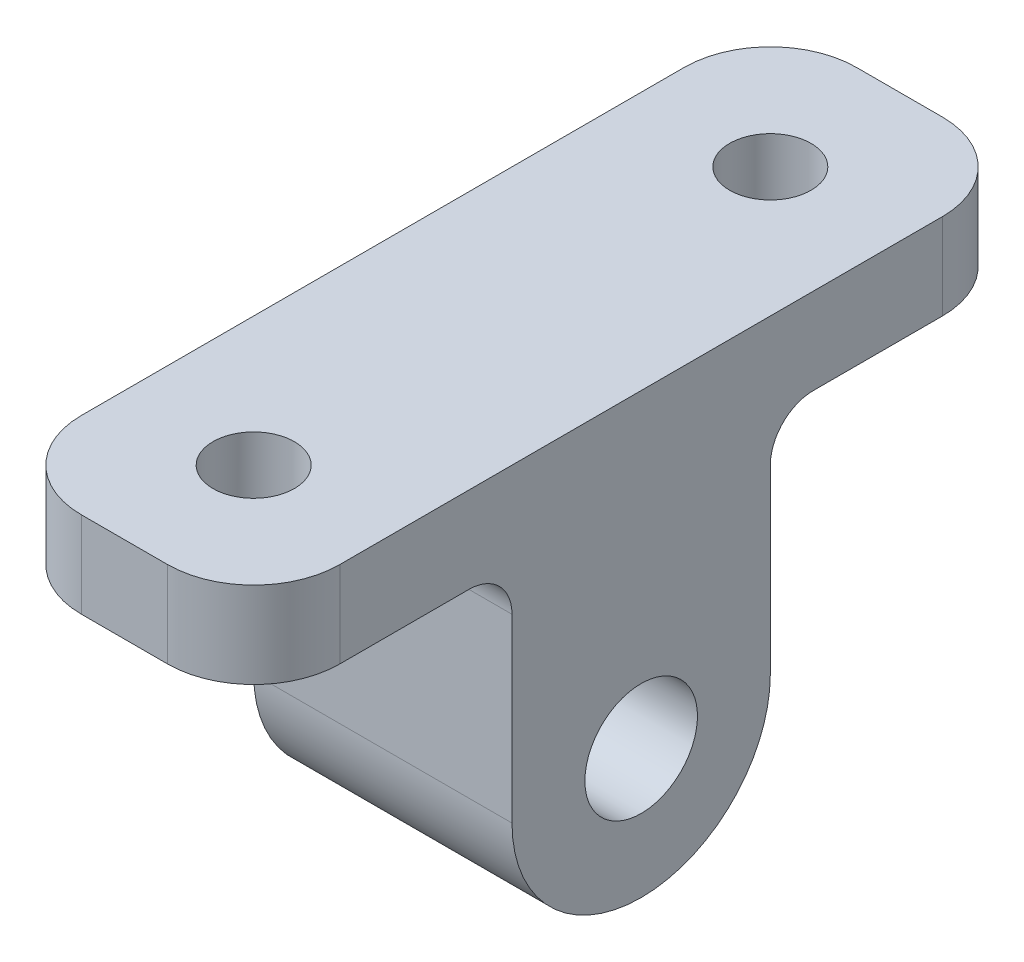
ISO-10303-21;
HEADER;
FILE_DESCRIPTION(('STEP AP214'),'2;1');
FILE_NAME('part.step','',(''),(''),'','','');
FILE_SCHEMA(('AUTOMOTIVE_DESIGN { 1 0 10303 214 1 1 1 1 }'));
ENDSEC;
DATA;
#1=APPLICATION_CONTEXT('core data for automotive mechanical design processes');
#2=APPLICATION_PROTOCOL_DEFINITION('international standard','automotive_design',2000,#1);
#3=PRODUCT_CONTEXT('',#1,'mechanical');
#4=PRODUCT('Part','Part','',(#3));
#5=PRODUCT_RELATED_PRODUCT_CATEGORY('part','',(#4));
#6=PRODUCT_DEFINITION_FORMATION('','',#4);
#7=PRODUCT_DEFINITION_CONTEXT('part definition',#1,'design');
#8=PRODUCT_DEFINITION('design','',#6,#7);
#9=PRODUCT_DEFINITION_SHAPE('','',#8);
#10=(LENGTH_UNIT() NAMED_UNIT(*) SI_UNIT(.MILLI.,.METRE.));
#11=(NAMED_UNIT(*) PLANE_ANGLE_UNIT() SI_UNIT($,.RADIAN.));
#12=(NAMED_UNIT(*) SI_UNIT($,.STERADIAN.) SOLID_ANGLE_UNIT());
#13=UNCERTAINTY_MEASURE_WITH_UNIT(LENGTH_MEASURE(1.E-05),#10,'distance_accuracy_value','');
#14=(GEOMETRIC_REPRESENTATION_CONTEXT(3) GLOBAL_UNCERTAINTY_ASSIGNED_CONTEXT((#13)) GLOBAL_UNIT_ASSIGNED_CONTEXT((#10,
#11,#12)) REPRESENTATION_CONTEXT('',''));
#15=CARTESIAN_POINT('',(0.,0.,0.));
#16=DIRECTION('',(0.,0.,1.));
#17=DIRECTION('',(1.,0.,0.));
#18=AXIS2_PLACEMENT_3D('',#15,#16,#17);
#19=CARTESIAN_POINT('',(9.525,0.,4.7625));
#20=DIRECTION('',(0.,0.,1.));
#21=DIRECTION('',(1.,0.,0.));
#22=AXIS2_PLACEMENT_3D('',#19,#20,#21);
#23=PLANE('',#22);
#24=DIRECTION('',(0.,1.,0.));
#25=VECTOR('',#24,1.);
#26=CARTESIAN_POINT('',(9.525,0.,4.7625));
#27=LINE('',#26,#25);
#28=CARTESIAN_POINT('',(9.525,0.,4.7625));
#29=VERTEX_POINT('',#28);
#30=CARTESIAN_POINT('',(9.525,6.6675,4.7625));
#31=VERTEX_POINT('',#30);
#32=EDGE_CURVE('E144',#29,#31,#27,.T.);
#33=ORIENTED_EDGE('',*,*,#32,.T.);
#34=DIRECTION('',(-1.,0.,0.));
#35=VECTOR('',#34,1.);
#36=CARTESIAN_POINT('',(0.,6.6675,4.7625));
#37=LINE('',#36,#35);
#38=CARTESIAN_POINT('',(0.,6.6675,4.7625));
#39=VERTEX_POINT('',#38);
#40=EDGE_CURVE('E249',#31,#39,#37,.T.);
#41=ORIENTED_EDGE('',*,*,#40,.T.);
#42=DIRECTION('',(0.,1.,0.));
#43=VECTOR('',#42,1.);
#44=CARTESIAN_POINT('',(0.,0.,4.7625));
#45=LINE('',#44,#43);
#46=CARTESIAN_POINT('',(0.,0.,4.7625));
#47=VERTEX_POINT('',#46);
#48=EDGE_CURVE('E147',#47,#39,#45,.T.);
#49=ORIENTED_EDGE('',*,*,#48,.F.);
#50=DIRECTION('',(-1.,0.,0.));
#51=VECTOR('',#50,1.);
#52=CARTESIAN_POINT('',(9.525,0.,4.7625));
#53=LINE('',#52,#51);
#54=EDGE_CURVE('E140',#29,#47,#53,.T.);
#55=ORIENTED_EDGE('',*,*,#54,.F.);
#56=EDGE_LOOP('',(#33,#41,#49,#55));
#57=FACE_BOUND('',#56,.T.);
#58=ADVANCED_FACE('F41',(#57),#23,.T.);
#59=CARTESIAN_POINT('',(9.525,0.,0.));
#60=DIRECTION('',(-1.,0.,0.));
#61=DIRECTION('',(0.,0.,1.));
#62=AXIS2_PLACEMENT_3D('',#59,#60,#61);
#63=CYLINDRICAL_SURFACE('',#62,4.7625);
#64=CARTESIAN_POINT('',(0.,0.,0.));
#65=DIRECTION('',(1.,0.,0.));
#66=DIRECTION('',(0.,0.,-1.));
#67=AXIS2_PLACEMENT_3D('',#64,#65,#66);
#68=CIRCLE('',#67,4.7625);
#69=CARTESIAN_POINT('',(0.,0.,-4.7625));
#70=VERTEX_POINT('',#69);
#71=EDGE_CURVE('E188',#47,#70,#68,.T.);
#72=ORIENTED_EDGE('',*,*,#71,.T.);
#73=DIRECTION('',(-1.,0.,0.));
#74=VECTOR('',#73,1.);
#75=CARTESIAN_POINT('',(9.525,0.,-4.7625));
#76=LINE('',#75,#74);
#77=CARTESIAN_POINT('',(9.525,0.,-4.7625));
#78=VERTEX_POINT('',#77);
#79=EDGE_CURVE('E152',#78,#70,#76,.T.);
#80=ORIENTED_EDGE('',*,*,#79,.F.);
#81=CARTESIAN_POINT('',(9.525,0.,0.));
#82=DIRECTION('',(1.,0.,0.));
#83=DIRECTION('',(0.,0.,-1.));
#84=AXIS2_PLACEMENT_3D('',#81,#82,#83);
#85=CIRCLE('',#84,4.7625);
#86=EDGE_CURVE('E156',#29,#78,#85,.T.);
#87=ORIENTED_EDGE('',*,*,#86,.F.);
#88=ORIENTED_EDGE('',*,*,#54,.T.);
#89=EDGE_LOOP('',(#72,#80,#87,#88));
#90=FACE_BOUND('',#89,.T.);
#91=ADVANCED_FACE('F157',(#90),#63,.T.);
#92=CARTESIAN_POINT('',(9.525,0.,-4.7625));
#93=DIRECTION('',(0.,0.,1.));
#94=DIRECTION('',(0.,-1.,0.));
#95=AXIS2_PLACEMENT_3D('',#92,#93,#94);
#96=PLANE('',#95);
#97=DIRECTION('',(0.,1.,0.));
#98=VECTOR('',#97,1.);
#99=CARTESIAN_POINT('',(0.,0.,-4.7625));
#100=LINE('',#99,#98);
#101=CARTESIAN_POINT('',(0.,6.6675,-4.7625));
#102=VERTEX_POINT('',#101);
#103=EDGE_CURVE('E190',#70,#102,#100,.T.);
#104=ORIENTED_EDGE('',*,*,#103,.T.);
#105=DIRECTION('',(-1.,0.,0.));
#106=VECTOR('',#105,1.);
#107=CARTESIAN_POINT('',(9.525,6.6675,-4.7625));
#108=LINE('',#107,#106);
#109=CARTESIAN_POINT('',(9.525,6.6675,-4.7625));
#110=VERTEX_POINT('',#109);
#111=EDGE_CURVE('E56',#102,#110,#108,.F.);
#112=ORIENTED_EDGE('',*,*,#111,.T.);
#113=DIRECTION('',(0.,1.,0.));
#114=VECTOR('',#113,1.);
#115=CARTESIAN_POINT('',(9.525,0.,-4.7625));
#116=LINE('',#115,#114);
#117=EDGE_CURVE('E160',#78,#110,#116,.T.);
#118=ORIENTED_EDGE('',*,*,#117,.F.);
#119=ORIENTED_EDGE('',*,*,#79,.T.);
#120=EDGE_LOOP('',(#104,#112,#118,#119));
#121=FACE_BOUND('',#120,.T.);
#122=ADVANCED_FACE('F285',(#121),#96,.F.);
#123=CARTESIAN_POINT('',(9.525,8.255,0.));
#124=DIRECTION('',(0.,1.,0.));
#125=DIRECTION('',(0.,0.,1.));
#126=AXIS2_PLACEMENT_3D('',#123,#124,#125);
#127=PLANE('',#126);
#128=CARTESIAN_POINT('',(4.7625,8.255,-9.525));
#129=DIRECTION('',(0.,1.,0.));
#130=DIRECTION('',(0.,0.,1.));
#131=AXIS2_PLACEMENT_3D('',#128,#129,#130);
#132=CIRCLE('',#131,1.5);
#133=CARTESIAN_POINT('',(4.7625,8.255,-8.025));
#134=VERTEX_POINT('',#133);
#135=EDGE_CURVE('E367',#134,#134,#132,.T.);
#136=ORIENTED_EDGE('',*,*,#135,.T.);
#137=EDGE_LOOP('',(#136));
#138=FACE_BOUND('',#137,.T.);
#139=DIRECTION('',(0.,0.,-1.));
#140=VECTOR('',#139,1.);
#141=CARTESIAN_POINT('',(9.525,8.255,0.));
#142=LINE('',#141,#140);
#143=CARTESIAN_POINT('',(9.525,8.255,-6.35));
#144=VERTEX_POINT('',#143);
#145=CARTESIAN_POINT('',(9.525,8.255,-11.1125));
#146=VERTEX_POINT('',#145);
#147=EDGE_CURVE('E175',#144,#146,#142,.T.);
#148=ORIENTED_EDGE('',*,*,#147,.F.);
#149=DIRECTION('',(-1.,0.,0.));
#150=VECTOR('',#149,1.);
#151=CARTESIAN_POINT('',(0.,8.255,-6.35));
#152=LINE('',#151,#150);
#153=CARTESIAN_POINT('',(0.,8.255,-6.35));
#154=VERTEX_POINT('',#153);
#155=EDGE_CURVE('E253',#144,#154,#152,.T.);
#156=ORIENTED_EDGE('',*,*,#155,.T.);
#157=DIRECTION('',(0.,0.,-1.));
#158=VECTOR('',#157,1.);
#159=CARTESIAN_POINT('',(0.,8.255,0.));
#160=LINE('',#159,#158);
#161=CARTESIAN_POINT('',(0.,8.255,-11.1125));
#162=VERTEX_POINT('',#161);
#163=EDGE_CURVE('E192',#154,#162,#160,.T.);
#164=ORIENTED_EDGE('',*,*,#163,.T.);
#165=CARTESIAN_POINT('',(3.175,8.255,-11.1125));
#166=DIRECTION('',(0.,1.,0.));
#167=DIRECTION('',(0.,0.,1.));
#168=AXIS2_PLACEMENT_3D('',#165,#166,#167);
#169=CIRCLE('',#168,3.175);
#170=CARTESIAN_POINT('',(3.175,8.255,-14.2875));
#171=VERTEX_POINT('',#170);
#172=EDGE_CURVE('E244',#162,#171,#169,.F.);
#173=ORIENTED_EDGE('',*,*,#172,.T.);
#174=DIRECTION('',(-1.,0.,0.));
#175=VECTOR('',#174,1.);
#176=CARTESIAN_POINT('',(9.525,8.255,-14.2875));
#177=LINE('',#176,#175);
#178=CARTESIAN_POINT('',(6.35,8.255,-14.2875));
#179=VERTEX_POINT('',#178);
#180=EDGE_CURVE('E206',#179,#171,#177,.T.);
#181=ORIENTED_EDGE('',*,*,#180,.F.);
#182=CARTESIAN_POINT('',(6.35,8.255,-11.1125));
#183=DIRECTION('',(0.,1.,0.));
#184=DIRECTION('',(0.,0.,1.));
#185=AXIS2_PLACEMENT_3D('',#182,#183,#184);
#186=CIRCLE('',#185,3.175);
#187=EDGE_CURVE('E246',#179,#146,#186,.F.);
#188=ORIENTED_EDGE('',*,*,#187,.T.);
#189=EDGE_LOOP('',(#148,#156,#164,#173,#181,#188));
#190=FACE_BOUND('',#189,.T.);
#191=ADVANCED_FACE('F313',(#138,#190),#127,.F.);
#192=CARTESIAN_POINT('',(9.525,0.,-14.2875));
#193=DIRECTION('',(0.,0.,1.));
#194=DIRECTION('',(0.,-1.,0.));
#195=AXIS2_PLACEMENT_3D('',#192,#193,#194);
#196=PLANE('',#195);
#197=DIRECTION('',(-1.,0.,0.));
#198=VECTOR('',#197,1.);
#199=CARTESIAN_POINT('',(9.525,11.43,-14.2875));
#200=LINE('',#199,#198);
#201=CARTESIAN_POINT('',(6.35,11.43,-14.2875));
#202=VERTEX_POINT('',#201);
#203=CARTESIAN_POINT('',(3.175,11.43,-14.2875));
#204=VERTEX_POINT('',#203);
#205=EDGE_CURVE('E203',#202,#204,#200,.T.);
#206=ORIENTED_EDGE('',*,*,#205,.F.);
#207=DIRECTION('',(0.,1.,0.));
#208=VECTOR('',#207,1.);
#209=CARTESIAN_POINT('',(6.35,8.255,-14.2875));
#210=LINE('',#209,#208);
#211=EDGE_CURVE('E242',#202,#179,#210,.F.);
#212=ORIENTED_EDGE('',*,*,#211,.T.);
#213=ORIENTED_EDGE('',*,*,#180,.T.);
#214=DIRECTION('',(0.,1.,0.));
#215=VECTOR('',#214,1.);
#216=CARTESIAN_POINT('',(3.175,0.,-14.2875));
#217=LINE('',#216,#215);
#218=EDGE_CURVE('E239',#171,#204,#217,.T.);
#219=ORIENTED_EDGE('',*,*,#218,.T.);
#220=EDGE_LOOP('',(#206,#212,#213,#219));
#221=FACE_BOUND('',#220,.T.);
#222=ADVANCED_FACE('F319',(#221),#196,.F.);
#223=CARTESIAN_POINT('',(9.525,11.43,0.));
#224=DIRECTION('',(0.,1.,0.));
#225=DIRECTION('',(0.,0.,1.));
#226=AXIS2_PLACEMENT_3D('',#223,#224,#225);
#227=PLANE('',#226);
#228=CARTESIAN_POINT('',(4.7625,11.43,-9.525));
#229=DIRECTION('',(0.,1.,0.));
#230=DIRECTION('',(0.,0.,1.));
#231=AXIS2_PLACEMENT_3D('',#228,#229,#230);
#232=CIRCLE('',#231,1.5);
#233=CARTESIAN_POINT('',(4.7625,11.43,-8.025));
#234=VERTEX_POINT('',#233);
#235=EDGE_CURVE('E364',#234,#234,#232,.T.);
#236=ORIENTED_EDGE('',*,*,#235,.F.);
#237=EDGE_LOOP('',(#236));
#238=FACE_BOUND('',#237,.T.);
#239=CARTESIAN_POINT('',(4.7625,11.43,9.525));
#240=DIRECTION('',(0.,1.,0.));
#241=DIRECTION('',(0.,0.,1.));
#242=AXIS2_PLACEMENT_3D('',#239,#240,#241);
#243=CIRCLE('',#242,1.5);
#244=CARTESIAN_POINT('',(4.7625,11.43,11.025));
#245=VERTEX_POINT('',#244);
#246=EDGE_CURVE('E368',#245,#245,#243,.T.);
#247=ORIENTED_EDGE('',*,*,#246,.F.);
#248=EDGE_LOOP('',(#247));
#249=FACE_BOUND('',#248,.T.);
#250=DIRECTION('',(-1.,0.,0.));
#251=VECTOR('',#250,1.);
#252=CARTESIAN_POINT('',(9.525,11.43,14.2875));
#253=LINE('',#252,#251);
#254=CARTESIAN_POINT('',(6.35,11.43,14.2875));
#255=VERTEX_POINT('',#254);
#256=CARTESIAN_POINT('',(3.175,11.43,14.2875));
#257=VERTEX_POINT('',#256);
#258=EDGE_CURVE('E200',#255,#257,#253,.T.);
#259=ORIENTED_EDGE('',*,*,#258,.F.);
#260=CARTESIAN_POINT('',(6.35,11.43,11.1125));
#261=DIRECTION('',(0.,1.,0.));
#262=DIRECTION('',(0.,0.,1.));
#263=AXIS2_PLACEMENT_3D('',#260,#261,#262);
#264=CIRCLE('',#263,3.175);
#265=CARTESIAN_POINT('',(9.525,11.43,11.1125));
#266=VERTEX_POINT('',#265);
#267=EDGE_CURVE('E220',#255,#266,#264,.T.);
#268=ORIENTED_EDGE('',*,*,#267,.T.);
#269=DIRECTION('',(0.,0.,-1.));
#270=VECTOR('',#269,1.);
#271=CARTESIAN_POINT('',(9.525,11.43,0.));
#272=LINE('',#271,#270);
#273=CARTESIAN_POINT('',(9.525,11.43,-11.1125));
#274=VERTEX_POINT('',#273);
#275=EDGE_CURVE('E177',#266,#274,#272,.T.);
#276=ORIENTED_EDGE('',*,*,#275,.T.);
#277=CARTESIAN_POINT('',(6.35,11.43,-11.1125));
#278=DIRECTION('',(0.,1.,0.));
#279=DIRECTION('',(0.,0.,1.));
#280=AXIS2_PLACEMENT_3D('',#277,#278,#279);
#281=CIRCLE('',#280,3.175);
#282=EDGE_CURVE('E216',#274,#202,#281,.T.);
#283=ORIENTED_EDGE('',*,*,#282,.T.);
#284=ORIENTED_EDGE('',*,*,#205,.T.);
#285=CARTESIAN_POINT('',(3.175,11.43,-11.1125));
#286=DIRECTION('',(0.,1.,0.));
#287=DIRECTION('',(0.,0.,1.));
#288=AXIS2_PLACEMENT_3D('',#285,#286,#287);
#289=CIRCLE('',#288,3.175);
#290=CARTESIAN_POINT('',(0.,11.43,-11.1125));
#291=VERTEX_POINT('',#290);
#292=EDGE_CURVE('E214',#204,#291,#289,.T.);
#293=ORIENTED_EDGE('',*,*,#292,.T.);
#294=DIRECTION('',(0.,0.,-1.));
#295=VECTOR('',#294,1.);
#296=CARTESIAN_POINT('',(0.,11.43,0.));
#297=LINE('',#296,#295);
#298=CARTESIAN_POINT('',(0.,11.43,11.1125));
#299=VERTEX_POINT('',#298);
#300=EDGE_CURVE('E194',#299,#291,#297,.T.);
#301=ORIENTED_EDGE('',*,*,#300,.F.);
#302=CARTESIAN_POINT('',(3.175,11.43,11.1125));
#303=DIRECTION('',(0.,1.,0.));
#304=DIRECTION('',(0.,0.,1.));
#305=AXIS2_PLACEMENT_3D('',#302,#303,#304);
#306=CIRCLE('',#305,3.175);
#307=EDGE_CURVE('E218',#299,#257,#306,.T.);
#308=ORIENTED_EDGE('',*,*,#307,.T.);
#309=EDGE_LOOP('',(#259,#268,#276,#283,#284,#293,#301,#308));
#310=FACE_BOUND('',#309,.T.);
#311=ADVANCED_FACE('F324',(#238,#249,#310),#227,.T.);
#312=CARTESIAN_POINT('',(9.525,0.,14.2875));
#313=DIRECTION('',(0.,0.,1.));
#314=DIRECTION('',(0.,-1.,0.));
#315=AXIS2_PLACEMENT_3D('',#312,#313,#314);
#316=PLANE('',#315);
#317=DIRECTION('',(-1.,0.,0.));
#318=VECTOR('',#317,1.);
#319=CARTESIAN_POINT('',(9.525,8.255,14.2875));
#320=LINE('',#319,#318);
#321=CARTESIAN_POINT('',(6.35,8.255,14.2875));
#322=VERTEX_POINT('',#321);
#323=CARTESIAN_POINT('',(3.175,8.255,14.2875));
#324=VERTEX_POINT('',#323);
#325=EDGE_CURVE('E182',#322,#324,#320,.T.);
#326=ORIENTED_EDGE('',*,*,#325,.F.);
#327=DIRECTION('',(0.,1.,0.));
#328=VECTOR('',#327,1.);
#329=CARTESIAN_POINT('',(6.35,0.,14.2875));
#330=LINE('',#329,#328);
#331=EDGE_CURVE('E211',#322,#255,#330,.T.);
#332=ORIENTED_EDGE('',*,*,#331,.T.);
#333=ORIENTED_EDGE('',*,*,#258,.T.);
#334=DIRECTION('',(0.,1.,0.));
#335=VECTOR('',#334,1.);
#336=CARTESIAN_POINT('',(3.175,8.255,14.2875));
#337=LINE('',#336,#335);
#338=EDGE_CURVE('E151',#257,#324,#337,.F.);
#339=ORIENTED_EDGE('',*,*,#338,.T.);
#340=EDGE_LOOP('',(#326,#332,#333,#339));
#341=FACE_BOUND('',#340,.T.);
#342=ADVANCED_FACE('F292',(#341),#316,.T.);
#343=CARTESIAN_POINT('',(9.525,0.,0.));
#344=DIRECTION('',(-1.,0.,0.));
#345=DIRECTION('',(0.,0.,1.));
#346=AXIS2_PLACEMENT_3D('',#343,#344,#345);
#347=CYLINDRICAL_SURFACE('',#346,2.075);
#348=CARTESIAN_POINT('',(9.525,0.,0.));
#349=DIRECTION('',(1.,0.,0.));
#350=DIRECTION('',(0.,0.,-1.));
#351=AXIS2_PLACEMENT_3D('',#348,#349,#350);
#352=CIRCLE('',#351,2.075);
#353=CARTESIAN_POINT('',(9.525,0.,2.075));
#354=VERTEX_POINT('',#353);
#355=EDGE_CURVE('E167',#354,#354,#352,.T.);
#356=CARTESIAN_POINT('',(0.,0.,0.));
#357=DIRECTION('',(1.,0.,0.));
#358=DIRECTION('',(0.,0.,-1.));
#359=AXIS2_PLACEMENT_3D('',#356,#357,#358);
#360=CIRCLE('',#359,2.075);
#361=CARTESIAN_POINT('',(0.,0.,2.075));
#362=VERTEX_POINT('',#361);
#363=EDGE_CURVE('E183',#362,#362,#360,.T.);
#364=CARTESIAN_POINT('',(9.525,0.,2.075));
#365=CARTESIAN_POINT('',(9.42578125,0.,2.075));
#366=CARTESIAN_POINT('',(9.3265625,0.,2.075));
#367=CARTESIAN_POINT('',(9.128125,0.,2.075));
#368=CARTESIAN_POINT('',(9.02890625,0.,2.075));
#369=CARTESIAN_POINT('',(8.83046875,0.,2.075));
#370=CARTESIAN_POINT('',(8.73125,0.,2.075));
#371=CARTESIAN_POINT('',(8.5328125,0.,2.075));
#372=CARTESIAN_POINT('',(8.43359375,0.,2.075));
#373=CARTESIAN_POINT('',(8.23515625,0.,2.075));
#374=CARTESIAN_POINT('',(8.1359375,0.,2.075));
#375=CARTESIAN_POINT('',(7.9375,0.,2.075));
#376=CARTESIAN_POINT('',(7.83828125,0.,2.075));
#377=CARTESIAN_POINT('',(7.63984375,0.,2.075));
#378=CARTESIAN_POINT('',(7.540625,0.,2.075));
#379=CARTESIAN_POINT('',(7.3421875,0.,2.075));
#380=CARTESIAN_POINT('',(7.24296875,0.,2.075));
#381=CARTESIAN_POINT('',(7.04453125,0.,2.075));
#382=CARTESIAN_POINT('',(6.9453125,0.,2.075));
#383=CARTESIAN_POINT('',(6.746875,0.,2.075));
#384=CARTESIAN_POINT('',(6.64765625,0.,2.075));
#385=CARTESIAN_POINT('',(6.44921875,0.,2.075));
#386=CARTESIAN_POINT('',(6.35,0.,2.075));
#387=CARTESIAN_POINT('',(6.1515625,0.,2.075));
#388=CARTESIAN_POINT('',(6.05234375,0.,2.075));
#389=CARTESIAN_POINT('',(5.85390625,0.,2.075));
#390=CARTESIAN_POINT('',(5.7546875,0.,2.075));
#391=CARTESIAN_POINT('',(5.55625,0.,2.075));
#392=CARTESIAN_POINT('',(5.45703125,0.,2.075));
#393=CARTESIAN_POINT('',(5.25859375,0.,2.075));
#394=CARTESIAN_POINT('',(5.159375,0.,2.075));
#395=CARTESIAN_POINT('',(4.9609375,0.,2.075));
#396=CARTESIAN_POINT('',(4.86171875,0.,2.075));
#397=CARTESIAN_POINT('',(4.66328125,0.,2.075));
#398=CARTESIAN_POINT('',(4.5640625,0.,2.075));
#399=CARTESIAN_POINT('',(4.365625,0.,2.075));
#400=CARTESIAN_POINT('',(4.26640625,0.,2.075));
#401=CARTESIAN_POINT('',(4.06796875,0.,2.075));
#402=CARTESIAN_POINT('',(3.96875,0.,2.075));
#403=CARTESIAN_POINT('',(3.7703125,0.,2.075));
#404=CARTESIAN_POINT('',(3.67109375,0.,2.075));
#405=CARTESIAN_POINT('',(3.47265625,0.,2.075));
#406=CARTESIAN_POINT('',(3.3734375,0.,2.075));
#407=CARTESIAN_POINT('',(3.175,0.,2.075));
#408=CARTESIAN_POINT('',(3.07578125,0.,2.075));
#409=CARTESIAN_POINT('',(2.87734375,0.,2.075));
#410=CARTESIAN_POINT('',(2.778125,0.,2.075));
#411=CARTESIAN_POINT('',(2.5796875,0.,2.075));
#412=CARTESIAN_POINT('',(2.48046875,0.,2.075));
#413=CARTESIAN_POINT('',(2.28203125,0.,2.075));
#414=CARTESIAN_POINT('',(2.1828125,0.,2.075));
#415=CARTESIAN_POINT('',(1.984375,0.,2.075));
#416=CARTESIAN_POINT('',(1.88515625,0.,2.075));
#417=CARTESIAN_POINT('',(1.68671875,0.,2.075));
#418=CARTESIAN_POINT('',(1.5875,0.,2.075));
#419=CARTESIAN_POINT('',(1.3890625,0.,2.075));
#420=CARTESIAN_POINT('',(1.28984375,0.,2.075));
#421=CARTESIAN_POINT('',(1.09140625,0.,2.075));
#422=CARTESIAN_POINT('',(0.992187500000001,0.,2.075));
#423=CARTESIAN_POINT('',(0.793750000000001,0.,2.075));
#424=CARTESIAN_POINT('',(0.69453125,0.,2.075));
#425=CARTESIAN_POINT('',(0.49609375,0.,2.075));
#426=CARTESIAN_POINT('',(0.396875,0.,2.075));
#427=CARTESIAN_POINT('',(0.1984375,0.,2.075));
#428=CARTESIAN_POINT('',(0.0992187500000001,0.,2.075));
#429=CARTESIAN_POINT('',(0.,0.,2.075));
#430=B_SPLINE_CURVE_WITH_KNOTS('',3,(#364,#365,#366,#367,#368,#369,#370,#371,#372,#373,#374,
#375,#376,#377,#378,#379,#380,#381,#382,#383,#384,#385,#386,#387,#388,#389,#390,#391,#392,#393,
#394,#395,#396,#397,#398,#399,#400,#401,#402,#403,#404,#405,#406,#407,#408,#409,#410,#411,#412,
#413,#414,#415,#416,#417,#418,#419,#420,#421,#422,#423,#424,#425,#426,#427,#428,#429),
.UNSPECIFIED.,.F.,.F.,(4,2,2,2,2,2,2,2,2,2,2,2,2,2,2,2,2,2,2,2,2,2,2,2,2,2,2,2,2,2,2,2,4),(0.,
0.29765625,0.5953125,0.892968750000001,1.190625,1.48828125,1.7859375,2.08359375,2.38125,
2.67890625,2.9765625,3.27421875,3.571875,3.86953125,4.1671875,4.46484375,4.7625,5.06015625,
5.3578125,5.65546875,5.953125,6.25078125,6.5484375,6.84609375,7.14375,7.44140625,7.7390625,
8.03671875,8.334375,8.63203125,8.9296875,9.22734375,9.525),.UNSPECIFIED.);
#431=EDGE_CURVE('BSEAM289',#354,#362,#430,.T.);
#432=ORIENTED_EDGE('',*,*,#355,.T.);
#433=ORIENTED_EDGE('',*,*,#363,.F.);
#434=ORIENTED_EDGE('',*,*,#431,.T.);
#435=ORIENTED_EDGE('',*,*,#431,.F.);
#436=EDGE_LOOP('',(#432,#434,#433,#435));
#437=FACE_BOUND('',#436,.T.);
#438=ADVANCED_FACE('F289',(#437),#347,.F.);
#439=CARTESIAN_POINT('',(9.525,8.255,0.));
#440=DIRECTION('',(0.,-1.,0.));
#441=DIRECTION('',(0.,0.,-1.));
#442=AXIS2_PLACEMENT_3D('',#439,#440,#441);
#443=PLANE('',#442);
#444=CARTESIAN_POINT('',(4.7625,8.255,9.525));
#445=DIRECTION('',(0.,-1.,0.));
#446=DIRECTION('',(0.,0.,-1.));
#447=AXIS2_PLACEMENT_3D('',#444,#445,#446);
#448=CIRCLE('',#447,1.5);
#449=CARTESIAN_POINT('',(4.7625,8.255,8.025));
#450=VERTEX_POINT('',#449);
#451=EDGE_CURVE('E186',#450,#450,#448,.T.);
#452=ORIENTED_EDGE('',*,*,#451,.F.);
#453=EDGE_LOOP('',(#452));
#454=FACE_BOUND('',#453,.T.);
#455=DIRECTION('',(0.,0.,1.));
#456=VECTOR('',#455,1.);
#457=CARTESIAN_POINT('',(0.,8.255,0.));
#458=LINE('',#457,#456);
#459=CARTESIAN_POINT('',(0.,8.255,6.35));
#460=VERTEX_POINT('',#459);
#461=CARTESIAN_POINT('',(0.,8.255,11.1125));
#462=VERTEX_POINT('',#461);
#463=EDGE_CURVE('E170',#460,#462,#458,.T.);
#464=ORIENTED_EDGE('',*,*,#463,.F.);
#465=DIRECTION('',(-1.,0.,0.));
#466=VECTOR('',#465,1.);
#467=CARTESIAN_POINT('',(9.525,8.255,6.35));
#468=LINE('',#467,#466);
#469=CARTESIAN_POINT('',(9.525,8.255,6.35));
#470=VERTEX_POINT('',#469);
#471=EDGE_CURVE('E251',#460,#470,#468,.F.);
#472=ORIENTED_EDGE('',*,*,#471,.T.);
#473=DIRECTION('',(0.,0.,1.));
#474=VECTOR('',#473,1.);
#475=CARTESIAN_POINT('',(9.525,8.255,0.));
#476=LINE('',#475,#474);
#477=CARTESIAN_POINT('',(9.525,8.255,11.1125));
#478=VERTEX_POINT('',#477);
#479=EDGE_CURVE('E180',#470,#478,#476,.T.);
#480=ORIENTED_EDGE('',*,*,#479,.T.);
#481=CARTESIAN_POINT('',(6.35,8.255,11.1125));
#482=DIRECTION('',(0.,-1.,0.));
#483=DIRECTION('',(0.,0.,-1.));
#484=AXIS2_PLACEMENT_3D('',#481,#482,#483);
#485=CIRCLE('',#484,3.175);
#486=EDGE_CURVE('E231',#478,#322,#485,.T.);
#487=ORIENTED_EDGE('',*,*,#486,.T.);
#488=ORIENTED_EDGE('',*,*,#325,.T.);
#489=CARTESIAN_POINT('',(3.175,8.255,11.1125));
#490=DIRECTION('',(0.,-1.,0.));
#491=DIRECTION('',(0.,0.,-1.));
#492=AXIS2_PLACEMENT_3D('',#489,#490,#491);
#493=CIRCLE('',#492,3.175);
#494=EDGE_CURVE('E228',#324,#462,#493,.T.);
#495=ORIENTED_EDGE('',*,*,#494,.T.);
#496=EDGE_LOOP('',(#464,#472,#480,#487,#488,#495));
#497=FACE_BOUND('',#496,.T.);
#498=ADVANCED_FACE('F264',(#454,#497),#443,.T.);
#499=CARTESIAN_POINT('',(9.525,0.,0.));
#500=DIRECTION('',(1.,0.,0.));
#501=DIRECTION('',(0.,0.,-1.));
#502=AXIS2_PLACEMENT_3D('',#499,#500,#501);
#503=PLANE('',#502);
#504=ORIENTED_EDGE('',*,*,#355,.F.);
#505=EDGE_LOOP('',(#504));
#506=FACE_BOUND('',#505,.T.);
#507=ORIENTED_EDGE('',*,*,#275,.F.);
#508=DIRECTION('',(0.,1.,0.));
#509=VECTOR('',#508,1.);
#510=CARTESIAN_POINT('',(9.525,0.,11.1125));
#511=LINE('',#510,#509);
#512=EDGE_CURVE('E225',#266,#478,#511,.F.);
#513=ORIENTED_EDGE('',*,*,#512,.T.);
#514=ORIENTED_EDGE('',*,*,#479,.F.);
#515=CARTESIAN_POINT('',(9.525,6.6675,6.35));
#516=DIRECTION('',(1.,0.,0.));
#517=DIRECTION('',(0.,0.,-1.));
#518=AXIS2_PLACEMENT_3D('',#515,#516,#517);
#519=CIRCLE('',#518,1.5875);
#520=EDGE_CURVE('E166',#470,#31,#519,.F.);
#521=ORIENTED_EDGE('',*,*,#520,.T.);
#522=ORIENTED_EDGE('',*,*,#32,.F.);
#523=ORIENTED_EDGE('',*,*,#86,.T.);
#524=ORIENTED_EDGE('',*,*,#117,.T.);
#525=CARTESIAN_POINT('',(9.525,6.6675,-6.35));
#526=DIRECTION('',(1.,0.,0.));
#527=DIRECTION('',(0.,0.,-1.));
#528=AXIS2_PLACEMENT_3D('',#525,#526,#527);
#529=CIRCLE('',#528,1.5875);
#530=EDGE_CURVE('E11',#110,#144,#529,.F.);
#531=ORIENTED_EDGE('',*,*,#530,.T.);
#532=ORIENTED_EDGE('',*,*,#147,.T.);
#533=DIRECTION('',(0.,1.,0.));
#534=VECTOR('',#533,1.);
#535=CARTESIAN_POINT('',(9.525,11.43,-11.1125));
#536=LINE('',#535,#534);
#537=EDGE_CURVE('E222',#146,#274,#536,.T.);
#538=ORIENTED_EDGE('',*,*,#537,.T.);
#539=EDGE_LOOP('',(#507,#513,#514,#521,#522,#523,#524,#531,#532,#538));
#540=FACE_BOUND('',#539,.T.);
#541=ADVANCED_FACE('F163',(#506,#540),#503,.T.);
#542=CARTESIAN_POINT('',(0.,0.,0.));
#543=DIRECTION('',(1.,0.,0.));
#544=DIRECTION('',(0.,0.,-1.));
#545=AXIS2_PLACEMENT_3D('',#542,#543,#544);
#546=PLANE('',#545);
#547=ORIENTED_EDGE('',*,*,#363,.T.);
#548=EDGE_LOOP('',(#547));
#549=FACE_BOUND('',#548,.T.);
#550=ORIENTED_EDGE('',*,*,#48,.T.);
#551=CARTESIAN_POINT('',(0.,6.6675,6.35));
#552=DIRECTION('',(1.,0.,0.));
#553=DIRECTION('',(0.,0.,-1.));
#554=AXIS2_PLACEMENT_3D('',#551,#552,#553);
#555=CIRCLE('',#554,1.5875);
#556=EDGE_CURVE('E257',#39,#460,#555,.T.);
#557=ORIENTED_EDGE('',*,*,#556,.T.);
#558=ORIENTED_EDGE('',*,*,#463,.T.);
#559=DIRECTION('',(0.,1.,0.));
#560=VECTOR('',#559,1.);
#561=CARTESIAN_POINT('',(0.,11.43,11.1125));
#562=LINE('',#561,#560);
#563=EDGE_CURVE('E236',#462,#299,#562,.T.);
#564=ORIENTED_EDGE('',*,*,#563,.T.);
#565=ORIENTED_EDGE('',*,*,#300,.T.);
#566=DIRECTION('',(0.,1.,0.));
#567=VECTOR('',#566,1.);
#568=CARTESIAN_POINT('',(0.,0.,-11.1125));
#569=LINE('',#568,#567);
#570=EDGE_CURVE('E233',#291,#162,#569,.F.);
#571=ORIENTED_EDGE('',*,*,#570,.T.);
#572=ORIENTED_EDGE('',*,*,#163,.F.);
#573=CARTESIAN_POINT('',(0.,6.6675,-6.35));
#574=DIRECTION('',(1.,0.,0.));
#575=DIRECTION('',(0.,0.,-1.));
#576=AXIS2_PLACEMENT_3D('',#573,#574,#575);
#577=CIRCLE('',#576,1.5875);
#578=EDGE_CURVE('E49',#154,#102,#577,.T.);
#579=ORIENTED_EDGE('',*,*,#578,.T.);
#580=ORIENTED_EDGE('',*,*,#103,.F.);
#581=ORIENTED_EDGE('',*,*,#71,.F.);
#582=EDGE_LOOP('',(#550,#557,#558,#564,#565,#571,#572,#579,#580,#581));
#583=FACE_BOUND('',#582,.T.);
#584=ADVANCED_FACE('F260',(#549,#583),#546,.F.);
#585=CARTESIAN_POINT('',(4.7625,11.43,9.525));
#586=DIRECTION('',(0.,1.,0.));
#587=DIRECTION('',(0.,0.,1.));
#588=AXIS2_PLACEMENT_3D('',#585,#586,#587);
#589=CYLINDRICAL_SURFACE('',#588,1.5);
#590=ORIENTED_EDGE('',*,*,#451,.T.);
#591=EDGE_LOOP('',(#590));
#592=FACE_BOUND('',#591,.T.);
#593=ORIENTED_EDGE('',*,*,#246,.T.);
#594=EDGE_LOOP('',(#593));
#595=FACE_BOUND('',#594,.T.);
#596=ADVANCED_FACE('F349',(#592,#595),#589,.F.);
#597=CARTESIAN_POINT('',(4.7625,11.43,-9.525));
#598=DIRECTION('',(0.,1.,0.));
#599=DIRECTION('',(0.,0.,1.));
#600=AXIS2_PLACEMENT_3D('',#597,#598,#599);
#601=CYLINDRICAL_SURFACE('',#600,1.5);
#602=ORIENTED_EDGE('',*,*,#235,.T.);
#603=EDGE_LOOP('',(#602));
#604=FACE_BOUND('',#603,.T.);
#605=ORIENTED_EDGE('',*,*,#135,.F.);
#606=EDGE_LOOP('',(#605));
#607=FACE_BOUND('',#606,.T.);
#608=ADVANCED_FACE('F298',(#604,#607),#601,.F.);
#609=CARTESIAN_POINT('',(6.35,0.,11.1125));
#610=DIRECTION('',(0.,1.,0.));
#611=DIRECTION('',(0.,0.,1.));
#612=AXIS2_PLACEMENT_3D('',#609,#610,#611);
#613=CYLINDRICAL_SURFACE('',#612,3.175);
#614=ORIENTED_EDGE('',*,*,#486,.F.);
#615=ORIENTED_EDGE('',*,*,#512,.F.);
#616=ORIENTED_EDGE('',*,*,#267,.F.);
#617=ORIENTED_EDGE('',*,*,#331,.F.);
#618=EDGE_LOOP('',(#614,#615,#616,#617));
#619=FACE_BOUND('',#618,.T.);
#620=ADVANCED_FACE('F294',(#619),#613,.T.);
#621=CARTESIAN_POINT('',(3.175,0.,11.1125));
#622=DIRECTION('',(0.,-1.,0.));
#623=DIRECTION('',(0.,0.,-1.));
#624=AXIS2_PLACEMENT_3D('',#621,#622,#623);
#625=CYLINDRICAL_SURFACE('',#624,3.175);
#626=ORIENTED_EDGE('',*,*,#494,.F.);
#627=ORIENTED_EDGE('',*,*,#338,.F.);
#628=ORIENTED_EDGE('',*,*,#307,.F.);
#629=ORIENTED_EDGE('',*,*,#563,.F.);
#630=EDGE_LOOP('',(#626,#627,#628,#629));
#631=FACE_BOUND('',#630,.T.);
#632=ADVANCED_FACE('F297',(#631),#625,.T.);
#633=CARTESIAN_POINT('',(6.35,0.,-11.1125));
#634=DIRECTION('',(0.,-1.,0.));
#635=DIRECTION('',(0.,0.,-1.));
#636=AXIS2_PLACEMENT_3D('',#633,#634,#635);
#637=CYLINDRICAL_SURFACE('',#636,3.175);
#638=ORIENTED_EDGE('',*,*,#187,.F.);
#639=ORIENTED_EDGE('',*,*,#211,.F.);
#640=ORIENTED_EDGE('',*,*,#282,.F.);
#641=ORIENTED_EDGE('',*,*,#537,.F.);
#642=EDGE_LOOP('',(#638,#639,#640,#641));
#643=FACE_BOUND('',#642,.T.);
#644=ADVANCED_FACE('F276',(#643),#637,.T.);
#645=CARTESIAN_POINT('',(3.175,0.,-11.1125));
#646=DIRECTION('',(0.,1.,0.));
#647=DIRECTION('',(0.,0.,1.));
#648=AXIS2_PLACEMENT_3D('',#645,#646,#647);
#649=CYLINDRICAL_SURFACE('',#648,3.175);
#650=ORIENTED_EDGE('',*,*,#172,.F.);
#651=ORIENTED_EDGE('',*,*,#570,.F.);
#652=ORIENTED_EDGE('',*,*,#292,.F.);
#653=ORIENTED_EDGE('',*,*,#218,.F.);
#654=EDGE_LOOP('',(#650,#651,#652,#653));
#655=FACE_BOUND('',#654,.T.);
#656=ADVANCED_FACE('F269',(#655),#649,.T.);
#657=CARTESIAN_POINT('',(9.525,6.6675,6.35));
#658=DIRECTION('',(1.,0.,0.));
#659=DIRECTION('',(0.,0.,-1.));
#660=AXIS2_PLACEMENT_3D('',#657,#658,#659);
#661=CYLINDRICAL_SURFACE('',#660,1.5875);
#662=ORIENTED_EDGE('',*,*,#520,.F.);
#663=ORIENTED_EDGE('',*,*,#471,.F.);
#664=ORIENTED_EDGE('',*,*,#556,.F.);
#665=ORIENTED_EDGE('',*,*,#40,.F.);
#666=EDGE_LOOP('',(#662,#663,#664,#665));
#667=FACE_BOUND('',#666,.T.);
#668=ADVANCED_FACE('F267',(#667),#661,.F.);
#669=CARTESIAN_POINT('',(9.525,6.6675,-6.35));
#670=DIRECTION('',(1.,0.,0.));
#671=DIRECTION('',(0.,0.,-1.));
#672=AXIS2_PLACEMENT_3D('',#669,#670,#671);
#673=CYLINDRICAL_SURFACE('',#672,1.5875);
#674=ORIENTED_EDGE('',*,*,#530,.F.);
#675=ORIENTED_EDGE('',*,*,#111,.F.);
#676=ORIENTED_EDGE('',*,*,#578,.F.);
#677=ORIENTED_EDGE('',*,*,#155,.F.);
#678=EDGE_LOOP('',(#674,#675,#676,#677));
#679=FACE_BOUND('',#678,.T.);
#680=ADVANCED_FACE('F43',(#679),#673,.F.);
#681=CLOSED_SHELL('',(#58,#91,#122,#191,#222,#311,#342,#438,#498,#541,#584,#596,#608,#620,#632,
#644,#656,#668,#680));
#682=MANIFOLD_SOLID_BREP('B2',#681);
#683=ADVANCED_BREP_SHAPE_REPRESENTATION('',(#18,#682),#14);
#684=SHAPE_DEFINITION_REPRESENTATION(#9,#683);
ENDSEC;
END-ISO-10303-21;
